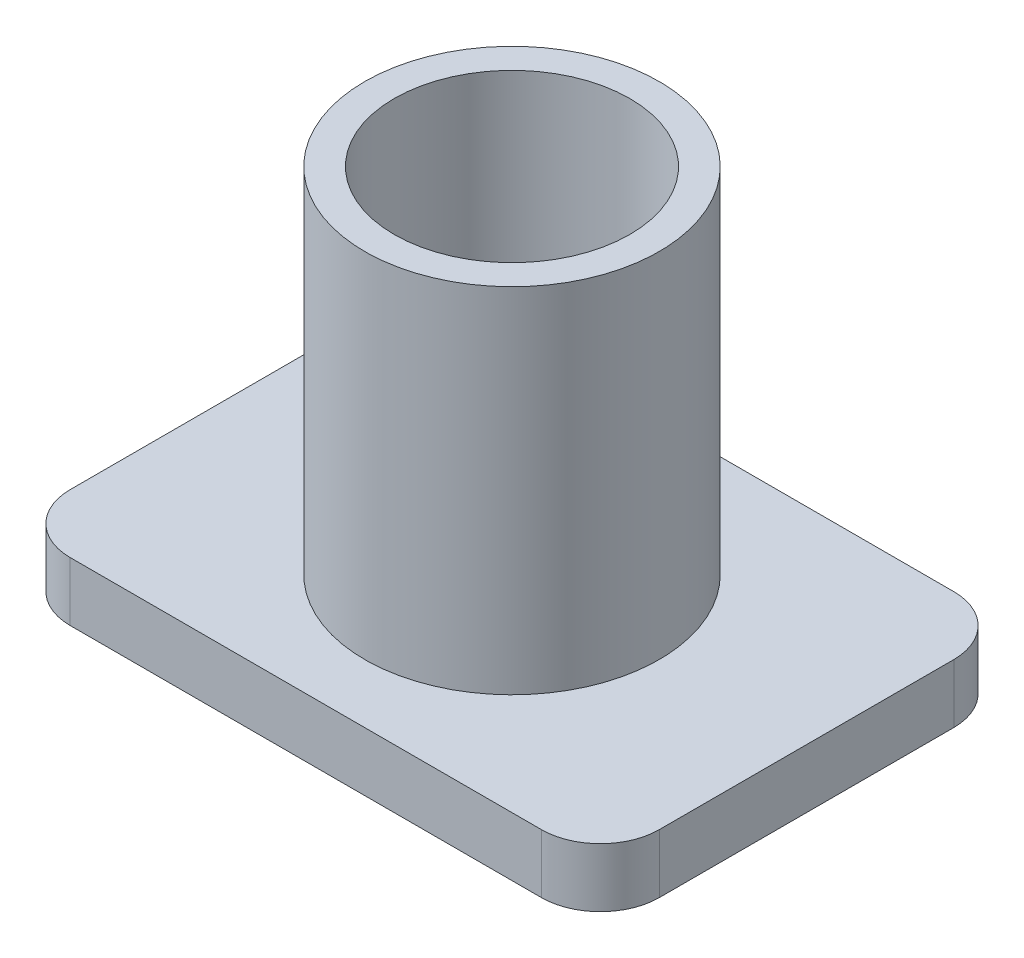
ISO-10303-21;
HEADER;
FILE_DESCRIPTION(('STEP AP214'),'2;1');
FILE_NAME('part.step','',(''),(''),'','','');
FILE_SCHEMA(('AUTOMOTIVE_DESIGN { 1 0 10303 214 1 1 1 1 }'));
ENDSEC;
DATA;
#1=APPLICATION_CONTEXT('core data for automotive mechanical design processes');
#2=APPLICATION_PROTOCOL_DEFINITION('international standard','automotive_design',2000,#1);
#3=PRODUCT_CONTEXT('',#1,'mechanical');
#4=PRODUCT('Part','Part','',(#3));
#5=PRODUCT_RELATED_PRODUCT_CATEGORY('part','',(#4));
#6=PRODUCT_DEFINITION_FORMATION('','',#4);
#7=PRODUCT_DEFINITION_CONTEXT('part definition',#1,'design');
#8=PRODUCT_DEFINITION('design','',#6,#7);
#9=PRODUCT_DEFINITION_SHAPE('','',#8);
#10=(LENGTH_UNIT() NAMED_UNIT(*) SI_UNIT(.MILLI.,.METRE.));
#11=(NAMED_UNIT(*) PLANE_ANGLE_UNIT() SI_UNIT($,.RADIAN.));
#12=(NAMED_UNIT(*) SI_UNIT($,.STERADIAN.) SOLID_ANGLE_UNIT());
#13=UNCERTAINTY_MEASURE_WITH_UNIT(LENGTH_MEASURE(1.E-05),#10,'distance_accuracy_value','');
#14=(GEOMETRIC_REPRESENTATION_CONTEXT(3) GLOBAL_UNCERTAINTY_ASSIGNED_CONTEXT((#13)) GLOBAL_UNIT_ASSIGNED_CONTEXT((#10,
#11,#12)) REPRESENTATION_CONTEXT('',''));
#15=CARTESIAN_POINT('',(0.,0.,0.));
#16=DIRECTION('',(0.,0.,1.));
#17=DIRECTION('',(1.,0.,0.));
#18=AXIS2_PLACEMENT_3D('',#15,#16,#17);
#19=CARTESIAN_POINT('',(-25.,5.,17.5));
#20=DIRECTION('',(0.,1.,0.));
#21=DIRECTION('',(0.,0.,1.));
#22=AXIS2_PLACEMENT_3D('',#19,#20,#21);
#23=PLANE('',#22);
#24=DIRECTION('',(1.,0.,0.));
#25=VECTOR('',#24,1.);
#26=CARTESIAN_POINT('',(-25.,5.,17.5));
#27=LINE('',#26,#25);
#28=CARTESIAN_POINT('',(-20.,5.,17.5));
#29=VERTEX_POINT('',#28);
#30=CARTESIAN_POINT('',(20.,5.,17.5));
#31=VERTEX_POINT('',#30);
#32=EDGE_CURVE('E142',#29,#31,#27,.T.);
#33=ORIENTED_EDGE('',*,*,#32,.T.);
#34=CARTESIAN_POINT('',(20.,5.,12.5));
#35=DIRECTION('',(0.,1.,0.));
#36=DIRECTION('',(0.,0.,1.));
#37=AXIS2_PLACEMENT_3D('',#34,#35,#36);
#38=CIRCLE('',#37,5.);
#39=CARTESIAN_POINT('',(25.,5.,12.5));
#40=VERTEX_POINT('',#39);
#41=EDGE_CURVE('E164',#31,#40,#38,.T.);
#42=ORIENTED_EDGE('',*,*,#41,.T.);
#43=DIRECTION('',(0.,0.,-1.));
#44=VECTOR('',#43,1.);
#45=CARTESIAN_POINT('',(25.,5.,-17.5));
#46=LINE('',#45,#44);
#47=CARTESIAN_POINT('',(25.,5.,-12.5));
#48=VERTEX_POINT('',#47);
#49=EDGE_CURVE('E125',#40,#48,#46,.T.);
#50=ORIENTED_EDGE('',*,*,#49,.T.);
#51=CARTESIAN_POINT('',(20.,5.,-12.5));
#52=DIRECTION('',(0.,1.,0.));
#53=DIRECTION('',(0.,0.,1.));
#54=AXIS2_PLACEMENT_3D('',#51,#52,#53);
#55=CIRCLE('',#54,5.);
#56=CARTESIAN_POINT('',(20.,5.,-17.5));
#57=VERTEX_POINT('',#56);
#58=EDGE_CURVE('E61',#48,#57,#55,.T.);
#59=ORIENTED_EDGE('',*,*,#58,.T.);
#60=DIRECTION('',(-1.,0.,0.));
#61=VECTOR('',#60,1.);
#62=CARTESIAN_POINT('',(-25.,5.,-17.5));
#63=LINE('',#62,#61);
#64=CARTESIAN_POINT('',(-20.,5.,-17.5));
#65=VERTEX_POINT('',#64);
#66=EDGE_CURVE('E146',#57,#65,#63,.T.);
#67=ORIENTED_EDGE('',*,*,#66,.T.);
#68=CARTESIAN_POINT('',(-20.,5.,-12.5));
#69=DIRECTION('',(0.,1.,0.));
#70=DIRECTION('',(0.,0.,1.));
#71=AXIS2_PLACEMENT_3D('',#68,#69,#70);
#72=CIRCLE('',#71,5.);
#73=CARTESIAN_POINT('',(-25.,5.,-12.5));
#74=VERTEX_POINT('',#73);
#75=EDGE_CURVE('E161',#65,#74,#72,.T.);
#76=ORIENTED_EDGE('',*,*,#75,.T.);
#77=DIRECTION('',(0.,0.,1.));
#78=VECTOR('',#77,1.);
#79=CARTESIAN_POINT('',(-25.,5.,-17.5));
#80=LINE('',#79,#78);
#81=CARTESIAN_POINT('',(-25.,5.,12.5));
#82=VERTEX_POINT('',#81);
#83=EDGE_CURVE('E134',#74,#82,#80,.T.);
#84=ORIENTED_EDGE('',*,*,#83,.T.);
#85=CARTESIAN_POINT('',(-20.,5.,12.5));
#86=DIRECTION('',(0.,1.,0.));
#87=DIRECTION('',(0.,0.,1.));
#88=AXIS2_PLACEMENT_3D('',#85,#86,#87);
#89=CIRCLE('',#88,5.);
#90=EDGE_CURVE('E159',#82,#29,#89,.T.);
#91=ORIENTED_EDGE('',*,*,#90,.T.);
#92=EDGE_LOOP('',(#33,#42,#50,#59,#67,#76,#84,#91));
#93=FACE_BOUND('',#92,.T.);
#94=CARTESIAN_POINT('',(0.,5.,0.));
#95=DIRECTION('',(0.,1.,0.));
#96=DIRECTION('',(-1.,0.,0.));
#97=AXIS2_PLACEMENT_3D('',#94,#95,#96);
#98=CIRCLE('',#97,12.5);
#99=CARTESIAN_POINT('',(-12.5,5.,0.));
#100=VERTEX_POINT('',#99);
#101=EDGE_CURVE('E186',#100,#100,#98,.T.);
#102=ORIENTED_EDGE('',*,*,#101,.F.);
#103=EDGE_LOOP('',(#102));
#104=FACE_BOUND('',#103,.T.);
#105=ADVANCED_FACE('F39',(#93,#104),#23,.T.);
#106=CARTESIAN_POINT('',(-25.,5.,-17.5));
#107=DIRECTION('',(1.,0.,0.));
#108=DIRECTION('',(0.,0.,-1.));
#109=AXIS2_PLACEMENT_3D('',#106,#107,#108);
#110=PLANE('',#109);
#111=ORIENTED_EDGE('',*,*,#83,.F.);
#112=DIRECTION('',(0.,-1.,0.));
#113=VECTOR('',#112,1.);
#114=CARTESIAN_POINT('',(-25.,5.,-12.5));
#115=LINE('',#114,#113);
#116=CARTESIAN_POINT('',(-25.,0.,-12.5));
#117=VERTEX_POINT('',#116);
#118=EDGE_CURVE('E12',#74,#117,#115,.T.);
#119=ORIENTED_EDGE('',*,*,#118,.T.);
#120=DIRECTION('',(0.,0.,1.));
#121=VECTOR('',#120,1.);
#122=CARTESIAN_POINT('',(-25.,0.,-17.5));
#123=LINE('',#122,#121);
#124=CARTESIAN_POINT('',(-25.,0.,12.5));
#125=VERTEX_POINT('',#124);
#126=EDGE_CURVE('E136',#117,#125,#123,.T.);
#127=ORIENTED_EDGE('',*,*,#126,.T.);
#128=DIRECTION('',(0.,-1.,0.));
#129=VECTOR('',#128,1.);
#130=CARTESIAN_POINT('',(-25.,5.,12.5));
#131=LINE('',#130,#129);
#132=EDGE_CURVE('E47',#125,#82,#131,.F.);
#133=ORIENTED_EDGE('',*,*,#132,.T.);
#134=EDGE_LOOP('',(#111,#119,#127,#133));
#135=FACE_BOUND('',#134,.T.);
#136=ADVANCED_FACE('F41',(#135),#110,.F.);
#137=CARTESIAN_POINT('',(-25.,5.,17.5));
#138=DIRECTION('',(0.,0.,-1.));
#139=DIRECTION('',(-1.,0.,0.));
#140=AXIS2_PLACEMENT_3D('',#137,#138,#139);
#141=PLANE('',#140);
#142=DIRECTION('',(1.,0.,0.));
#143=VECTOR('',#142,1.);
#144=CARTESIAN_POINT('',(-25.,0.,17.5));
#145=LINE('',#144,#143);
#146=CARTESIAN_POINT('',(-20.,0.,17.5));
#147=VERTEX_POINT('',#146);
#148=CARTESIAN_POINT('',(20.,0.,17.5));
#149=VERTEX_POINT('',#148);
#150=EDGE_CURVE('E132',#147,#149,#145,.T.);
#151=ORIENTED_EDGE('',*,*,#150,.T.);
#152=DIRECTION('',(0.,-1.,0.));
#153=VECTOR('',#152,1.);
#154=CARTESIAN_POINT('',(20.,5.,17.5));
#155=LINE('',#154,#153);
#156=EDGE_CURVE('E111',#149,#31,#155,.F.);
#157=ORIENTED_EDGE('',*,*,#156,.T.);
#158=ORIENTED_EDGE('',*,*,#32,.F.);
#159=DIRECTION('',(0.,-1.,0.));
#160=VECTOR('',#159,1.);
#161=CARTESIAN_POINT('',(-20.,5.,17.5));
#162=LINE('',#161,#160);
#163=EDGE_CURVE('E116',#29,#147,#162,.T.);
#164=ORIENTED_EDGE('',*,*,#163,.T.);
#165=EDGE_LOOP('',(#151,#157,#158,#164));
#166=FACE_BOUND('',#165,.T.);
#167=ADVANCED_FACE('F183',(#166),#141,.F.);
#168=CARTESIAN_POINT('',(25.,5.,-17.5));
#169=DIRECTION('',(-1.,0.,0.));
#170=DIRECTION('',(0.,0.,1.));
#171=AXIS2_PLACEMENT_3D('',#168,#169,#170);
#172=PLANE('',#171);
#173=ORIENTED_EDGE('',*,*,#49,.F.);
#174=DIRECTION('',(0.,-1.,0.));
#175=VECTOR('',#174,1.);
#176=CARTESIAN_POINT('',(25.,5.,12.5));
#177=LINE('',#176,#175);
#178=CARTESIAN_POINT('',(25.,0.,12.5));
#179=VERTEX_POINT('',#178);
#180=EDGE_CURVE('E110',#40,#179,#177,.T.);
#181=ORIENTED_EDGE('',*,*,#180,.T.);
#182=DIRECTION('',(0.,0.,-1.));
#183=VECTOR('',#182,1.);
#184=CARTESIAN_POINT('',(25.,0.,-17.5));
#185=LINE('',#184,#183);
#186=CARTESIAN_POINT('',(25.,0.,-12.5));
#187=VERTEX_POINT('',#186);
#188=EDGE_CURVE('E123',#179,#187,#185,.T.);
#189=ORIENTED_EDGE('',*,*,#188,.T.);
#190=DIRECTION('',(0.,-1.,0.));
#191=VECTOR('',#190,1.);
#192=CARTESIAN_POINT('',(25.,5.,-12.5));
#193=LINE('',#192,#191);
#194=EDGE_CURVE('E127',#187,#48,#193,.F.);
#195=ORIENTED_EDGE('',*,*,#194,.T.);
#196=EDGE_LOOP('',(#173,#181,#189,#195));
#197=FACE_BOUND('',#196,.T.);
#198=ADVANCED_FACE('F122',(#197),#172,.F.);
#199=CARTESIAN_POINT('',(-25.,5.,-17.5));
#200=DIRECTION('',(0.,0.,1.));
#201=DIRECTION('',(1.,0.,0.));
#202=AXIS2_PLACEMENT_3D('',#199,#200,#201);
#203=PLANE('',#202);
#204=ORIENTED_EDGE('',*,*,#66,.F.);
#205=DIRECTION('',(0.,-1.,0.));
#206=VECTOR('',#205,1.);
#207=CARTESIAN_POINT('',(20.,5.,-17.5));
#208=LINE('',#207,#206);
#209=CARTESIAN_POINT('',(20.,0.,-17.5));
#210=VERTEX_POINT('',#209);
#211=EDGE_CURVE('E167',#57,#210,#208,.T.);
#212=ORIENTED_EDGE('',*,*,#211,.T.);
#213=DIRECTION('',(-1.,0.,0.));
#214=VECTOR('',#213,1.);
#215=CARTESIAN_POINT('',(-25.,0.,-17.5));
#216=LINE('',#215,#214);
#217=CARTESIAN_POINT('',(-20.,0.,-17.5));
#218=VERTEX_POINT('',#217);
#219=EDGE_CURVE('E131',#210,#218,#216,.T.);
#220=ORIENTED_EDGE('',*,*,#219,.T.);
#221=DIRECTION('',(0.,-1.,0.));
#222=VECTOR('',#221,1.);
#223=CARTESIAN_POINT('',(-20.,5.,-17.5));
#224=LINE('',#223,#222);
#225=EDGE_CURVE('E54',#218,#65,#224,.F.);
#226=ORIENTED_EDGE('',*,*,#225,.T.);
#227=EDGE_LOOP('',(#204,#212,#220,#226));
#228=FACE_BOUND('',#227,.T.);
#229=ADVANCED_FACE('F209',(#228),#203,.F.);
#230=CARTESIAN_POINT('',(-25.,0.,17.5));
#231=DIRECTION('',(0.,1.,0.));
#232=DIRECTION('',(0.,0.,1.));
#233=AXIS2_PLACEMENT_3D('',#230,#231,#232);
#234=PLANE('',#233);
#235=ORIENTED_EDGE('',*,*,#188,.F.);
#236=CARTESIAN_POINT('',(20.,0.,12.5));
#237=DIRECTION('',(0.,1.,0.));
#238=DIRECTION('',(0.,0.,1.));
#239=AXIS2_PLACEMENT_3D('',#236,#237,#238);
#240=CIRCLE('',#239,5.);
#241=EDGE_CURVE('E106',#179,#149,#240,.F.);
#242=ORIENTED_EDGE('',*,*,#241,.T.);
#243=ORIENTED_EDGE('',*,*,#150,.F.);
#244=CARTESIAN_POINT('',(-20.,0.,12.5));
#245=DIRECTION('',(0.,1.,0.));
#246=DIRECTION('',(0.,0.,1.));
#247=AXIS2_PLACEMENT_3D('',#244,#245,#246);
#248=CIRCLE('',#247,5.);
#249=EDGE_CURVE('E126',#147,#125,#248,.F.);
#250=ORIENTED_EDGE('',*,*,#249,.T.);
#251=ORIENTED_EDGE('',*,*,#126,.F.);
#252=CARTESIAN_POINT('',(-20.,0.,-12.5));
#253=DIRECTION('',(0.,1.,0.));
#254=DIRECTION('',(0.,0.,1.));
#255=AXIS2_PLACEMENT_3D('',#252,#253,#254);
#256=CIRCLE('',#255,5.);
#257=EDGE_CURVE('E153',#117,#218,#256,.F.);
#258=ORIENTED_EDGE('',*,*,#257,.T.);
#259=ORIENTED_EDGE('',*,*,#219,.F.);
#260=CARTESIAN_POINT('',(20.,0.,-12.5));
#261=DIRECTION('',(0.,1.,0.));
#262=DIRECTION('',(0.,0.,1.));
#263=AXIS2_PLACEMENT_3D('',#260,#261,#262);
#264=CIRCLE('',#263,5.);
#265=EDGE_CURVE('E117',#210,#187,#264,.F.);
#266=ORIENTED_EDGE('',*,*,#265,.T.);
#267=EDGE_LOOP('',(#235,#242,#243,#250,#251,#258,#259,#266));
#268=FACE_BOUND('',#267,.T.);
#269=ADVANCED_FACE('F129',(#268),#234,.F.);
#270=CARTESIAN_POINT('',(0.,35.,0.));
#271=DIRECTION('',(0.,1.,0.));
#272=DIRECTION('',(0.,0.,1.));
#273=AXIS2_PLACEMENT_3D('',#270,#271,#272);
#274=PLANE('',#273);
#275=CARTESIAN_POINT('',(0.,35.,0.));
#276=DIRECTION('',(0.,1.,0.));
#277=DIRECTION('',(-1.,0.,0.));
#278=AXIS2_PLACEMENT_3D('',#275,#276,#277);
#279=CIRCLE('',#278,12.5);
#280=CARTESIAN_POINT('',(-12.5,35.,0.));
#281=VERTEX_POINT('',#280);
#282=EDGE_CURVE('E184',#281,#281,#279,.T.);
#283=ORIENTED_EDGE('',*,*,#282,.T.);
#284=EDGE_LOOP('',(#283));
#285=FACE_BOUND('',#284,.T.);
#286=CARTESIAN_POINT('',(0.,35.,0.));
#287=DIRECTION('',(0.,1.,0.));
#288=DIRECTION('',(0.,0.,1.));
#289=AXIS2_PLACEMENT_3D('',#286,#287,#288);
#290=CIRCLE('',#289,10.);
#291=CARTESIAN_POINT('',(0.,35.,10.));
#292=VERTEX_POINT('',#291);
#293=EDGE_CURVE('E191',#292,#292,#290,.T.);
#294=ORIENTED_EDGE('',*,*,#293,.F.);
#295=EDGE_LOOP('',(#294));
#296=FACE_BOUND('',#295,.T.);
#297=ADVANCED_FACE('F198',(#285,#296),#274,.T.);
#298=CARTESIAN_POINT('',(0.,35.,0.));
#299=DIRECTION('',(0.,-1.,0.));
#300=DIRECTION('',(0.,0.,-1.));
#301=AXIS2_PLACEMENT_3D('',#298,#299,#300);
#302=CYLINDRICAL_SURFACE('',#301,12.5);
#303=ORIENTED_EDGE('',*,*,#282,.F.);
#304=EDGE_LOOP('',(#303));
#305=FACE_BOUND('',#304,.T.);
#306=ORIENTED_EDGE('',*,*,#101,.T.);
#307=EDGE_LOOP('',(#306));
#308=FACE_BOUND('',#307,.T.);
#309=ADVANCED_FACE('F200',(#305,#308),#302,.T.);
#310=CARTESIAN_POINT('',(0.,35.,0.));
#311=DIRECTION('',(0.,-1.,0.));
#312=DIRECTION('',(0.,0.,-1.));
#313=AXIS2_PLACEMENT_3D('',#310,#311,#312);
#314=CYLINDRICAL_SURFACE('',#313,10.);
#315=ORIENTED_EDGE('',*,*,#293,.T.);
#316=EDGE_LOOP('',(#315));
#317=FACE_BOUND('',#316,.T.);
#318=CARTESIAN_POINT('',(0.,5.,0.));
#319=DIRECTION('',(0.,1.,0.));
#320=DIRECTION('',(0.,0.,1.));
#321=AXIS2_PLACEMENT_3D('',#318,#319,#320);
#322=CIRCLE('',#321,10.);
#323=CARTESIAN_POINT('',(0.,5.,10.));
#324=VERTEX_POINT('',#323);
#325=EDGE_CURVE('E148',#324,#324,#322,.F.);
#326=ORIENTED_EDGE('',*,*,#325,.T.);
#327=EDGE_LOOP('',(#326));
#328=FACE_BOUND('',#327,.T.);
#329=ADVANCED_FACE('F195',(#317,#328),#314,.F.);
#330=ORIENTED_EDGE('',*,*,#325,.F.);
#331=EDGE_LOOP('',(#330));
#332=FACE_BOUND('',#331,.T.);
#333=ADVANCED_FACE('F214',(#332),#23,.T.);
#334=CARTESIAN_POINT('',(20.,5.,12.5));
#335=DIRECTION('',(0.,-1.,0.));
#336=DIRECTION('',(0.,0.,-1.));
#337=AXIS2_PLACEMENT_3D('',#334,#335,#336);
#338=CYLINDRICAL_SURFACE('',#337,5.);
#339=ORIENTED_EDGE('',*,*,#41,.F.);
#340=ORIENTED_EDGE('',*,*,#156,.F.);
#341=ORIENTED_EDGE('',*,*,#241,.F.);
#342=ORIENTED_EDGE('',*,*,#180,.F.);
#343=EDGE_LOOP('',(#339,#340,#341,#342));
#344=FACE_BOUND('',#343,.T.);
#345=ADVANCED_FACE('F109',(#344),#338,.T.);
#346=CARTESIAN_POINT('',(20.,5.,-12.5));
#347=DIRECTION('',(0.,-1.,0.));
#348=DIRECTION('',(0.,0.,-1.));
#349=AXIS2_PLACEMENT_3D('',#346,#347,#348);
#350=CYLINDRICAL_SURFACE('',#349,5.);
#351=ORIENTED_EDGE('',*,*,#58,.F.);
#352=ORIENTED_EDGE('',*,*,#194,.F.);
#353=ORIENTED_EDGE('',*,*,#265,.F.);
#354=ORIENTED_EDGE('',*,*,#211,.F.);
#355=EDGE_LOOP('',(#351,#352,#353,#354));
#356=FACE_BOUND('',#355,.T.);
#357=ADVANCED_FACE('F225',(#356),#350,.T.);
#358=CARTESIAN_POINT('',(-20.,5.,-12.5));
#359=DIRECTION('',(0.,-1.,0.));
#360=DIRECTION('',(0.,0.,-1.));
#361=AXIS2_PLACEMENT_3D('',#358,#359,#360);
#362=CYLINDRICAL_SURFACE('',#361,5.);
#363=ORIENTED_EDGE('',*,*,#75,.F.);
#364=ORIENTED_EDGE('',*,*,#225,.F.);
#365=ORIENTED_EDGE('',*,*,#257,.F.);
#366=ORIENTED_EDGE('',*,*,#118,.F.);
#367=EDGE_LOOP('',(#363,#364,#365,#366));
#368=FACE_BOUND('',#367,.T.);
#369=ADVANCED_FACE('F233',(#368),#362,.T.);
#370=CARTESIAN_POINT('',(-20.,5.,12.5));
#371=DIRECTION('',(0.,-1.,0.));
#372=DIRECTION('',(0.,0.,-1.));
#373=AXIS2_PLACEMENT_3D('',#370,#371,#372);
#374=CYLINDRICAL_SURFACE('',#373,5.);
#375=ORIENTED_EDGE('',*,*,#90,.F.);
#376=ORIENTED_EDGE('',*,*,#132,.F.);
#377=ORIENTED_EDGE('',*,*,#249,.F.);
#378=ORIENTED_EDGE('',*,*,#163,.F.);
#379=EDGE_LOOP('',(#375,#376,#377,#378));
#380=FACE_BOUND('',#379,.T.);
#381=ADVANCED_FACE('F181',(#380),#374,.T.);
#382=CLOSED_SHELL('',(#105,#136,#167,#198,#229,#269,#297,#309,#329,#333,#345,#357,#369,#381));
#383=MANIFOLD_SOLID_BREP('B2',#382);
#384=ADVANCED_BREP_SHAPE_REPRESENTATION('',(#18,#383),#14);
#385=SHAPE_DEFINITION_REPRESENTATION(#9,#384);
ENDSEC;
END-ISO-10303-21;
